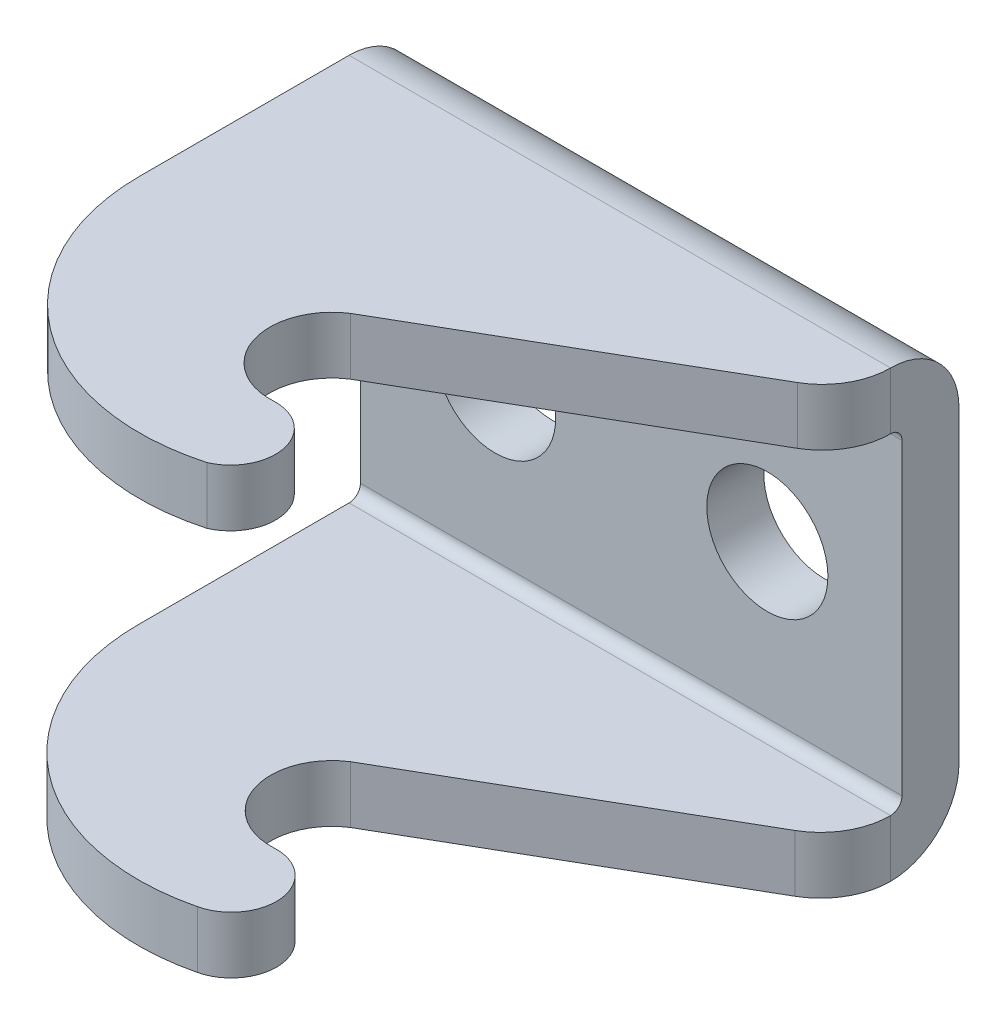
ISO-10303-21;
HEADER;
FILE_DESCRIPTION(('STEP AP214'),'2;1');
FILE_NAME('part.step','',(''),(''),'','','');
FILE_SCHEMA(('AUTOMOTIVE_DESIGN { 1 0 10303 214 1 1 1 1 }'));
ENDSEC;
DATA;
#1=APPLICATION_CONTEXT('core data for automotive mechanical design processes');
#2=APPLICATION_PROTOCOL_DEFINITION('international standard','automotive_design',2000,#1);
#3=PRODUCT_CONTEXT('',#1,'mechanical');
#4=PRODUCT('Part','Part','',(#3));
#5=PRODUCT_RELATED_PRODUCT_CATEGORY('part','',(#4));
#6=PRODUCT_DEFINITION_FORMATION('','',#4);
#7=PRODUCT_DEFINITION_CONTEXT('part definition',#1,'design');
#8=PRODUCT_DEFINITION('design','',#6,#7);
#9=PRODUCT_DEFINITION_SHAPE('','',#8);
#10=(LENGTH_UNIT() NAMED_UNIT(*) SI_UNIT(.MILLI.,.METRE.));
#11=(NAMED_UNIT(*) PLANE_ANGLE_UNIT() SI_UNIT($,.RADIAN.));
#12=(NAMED_UNIT(*) SI_UNIT($,.STERADIAN.) SOLID_ANGLE_UNIT());
#13=UNCERTAINTY_MEASURE_WITH_UNIT(LENGTH_MEASURE(1.E-05),#10,'distance_accuracy_value','');
#14=(GEOMETRIC_REPRESENTATION_CONTEXT(3) GLOBAL_UNCERTAINTY_ASSIGNED_CONTEXT((#13)) GLOBAL_UNIT_ASSIGNED_CONTEXT((#10,
#11,#12)) REPRESENTATION_CONTEXT('',''));
#15=CARTESIAN_POINT('',(0.,0.,0.));
#16=DIRECTION('',(0.,0.,1.));
#17=DIRECTION('',(1.,0.,0.));
#18=AXIS2_PLACEMENT_3D('',#15,#16,#17);
#19=CARTESIAN_POINT('',(9.05,15.6,31.6254571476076));
#20=DIRECTION('',(0.,-1.,0.));
#21=DIRECTION('',(0.,0.,1.));
#22=AXIS2_PLACEMENT_3D('',#19,#20,#21);
#23=PLANE('',#22);
#24=DIRECTION('',(1.,0.,0.));
#25=VECTOR('',#24,1.);
#26=CARTESIAN_POINT('',(-28.9122467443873,15.6,4.8));
#27=LINE('',#26,#25);
#28=CARTESIAN_POINT('',(-9.4499999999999,15.6,4.8));
#29=VERTEX_POINT('',#28);
#30=CARTESIAN_POINT('',(28.55,15.6,4.8));
#31=VERTEX_POINT('',#30);
#32=EDGE_CURVE('E300',#29,#31,#27,.T.);
#33=ORIENTED_EDGE('',*,*,#32,.F.);
#34=DIRECTION('',(0.,0.,1.));
#35=VECTOR('',#34,1.);
#36=CARTESIAN_POINT('',(-9.4499999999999,15.6,19.5041133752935));
#37=LINE('',#36,#35);
#38=CARTESIAN_POINT('',(-9.4499999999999,15.6,19.5041133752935));
#39=VERTEX_POINT('',#38);
#40=EDGE_CURVE('E264',#39,#29,#37,.F.);
#41=ORIENTED_EDGE('',*,*,#40,.F.);
#42=CARTESIAN_POINT('',(6.1467717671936,15.6,19.5041133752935));
#43=DIRECTION('',(0.,-1.,0.));
#44=DIRECTION('',(0.,0.,1.));
#45=AXIS2_PLACEMENT_3D('',#42,#43,#44);
#46=CIRCLE('',#45,15.5967717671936);
#47=CARTESIAN_POINT('',(10.3055796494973,15.6,34.5361992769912));
#48=VERTEX_POINT('',#47);
#49=EDGE_CURVE('E145',#48,#39,#46,.T.);
#50=ORIENTED_EDGE('',*,*,#49,.F.);
#51=CARTESIAN_POINT('',(9.05,15.6,31.6254571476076));
#52=DIRECTION('',(0.,-1.,0.));
#53=DIRECTION('',(0.,0.,1.));
#54=AXIS2_PLACEMENT_3D('',#51,#52,#53);
#55=CIRCLE('',#54,3.17);
#56=CARTESIAN_POINT('',(8.92464388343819,15.6,28.4579366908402));
#57=VERTEX_POINT('',#56);
#58=EDGE_CURVE('E143',#57,#48,#55,.T.);
#59=ORIENTED_EDGE('',*,*,#58,.F.);
#60=CARTESIAN_POINT('',(8.65,15.6,24.1008851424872));
#61=DIRECTION('',(0.,-1.,0.));
#62=DIRECTION('',(0.,0.,1.));
#63=AXIS2_PLACEMENT_3D('',#60,#61,#62);
#64=CIRCLE('',#63,4.36569896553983);
#65=CARTESIAN_POINT('',(6.28596056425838,15.6,20.4306474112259));
#66=VERTEX_POINT('',#65);
#67=EDGE_CURVE('E132',#57,#66,#64,.T.);
#68=ORIENTED_EDGE('',*,*,#67,.T.);
#69=DIRECTION('',(0.86602540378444,0.,-0.5));
#70=VECTOR('',#69,1.);
#71=CARTESIAN_POINT('',(26.1618466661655,15.6,8.95529921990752));
#72=LINE('',#71,#70);
#73=CARTESIAN_POINT('',(26.1618466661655,15.6,8.95529921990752));
#74=VERTEX_POINT('',#73);
#75=EDGE_CURVE('E159',#74,#66,#72,.F.);
#76=ORIENTED_EDGE('',*,*,#75,.F.);
#77=CARTESIAN_POINT('',(23.7736933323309,15.6,4.81889630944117));
#78=DIRECTION('',(0.,-1.,0.));
#79=DIRECTION('',(0.,0.,1.));
#80=AXIS2_PLACEMENT_3D('',#77,#78,#79);
#81=CIRCLE('',#80,4.77630666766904);
#82=CARTESIAN_POINT('',(28.55,15.6,4.81889630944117));
#83=VERTEX_POINT('',#82);
#84=EDGE_CURVE('E17',#83,#74,#81,.T.);
#85=ORIENTED_EDGE('',*,*,#84,.F.);
#86=DIRECTION('',(0.,0.,-1.));
#87=VECTOR('',#86,1.);
#88=CARTESIAN_POINT('',(28.55,15.6,-25.6171260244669));
#89=LINE('',#88,#87);
#90=EDGE_CURVE('E173',#31,#83,#89,.F.);
#91=ORIENTED_EDGE('',*,*,#90,.F.);
#92=EDGE_LOOP('',(#33,#41,#50,#59,#68,#76,#85,#91));
#93=FACE_BOUND('',#92,.T.);
#94=ADVANCED_FACE('F14',(#93),#23,.F.);
#95=CARTESIAN_POINT('',(9.04999999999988,-15.6017702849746,-52.4236868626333));
#96=DIRECTION('',(0.,1.,0.));
#97=DIRECTION('',(0.,0.,-1.));
#98=AXIS2_PLACEMENT_3D('',#95,#96,#97);
#99=PLANE('',#98);
#100=DIRECTION('',(0.,0.,-1.));
#101=VECTOR('',#100,1.);
#102=CARTESIAN_POINT('',(28.55,-15.6017702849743,4.81889630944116));
#103=LINE('',#102,#101);
#104=CARTESIAN_POINT('',(28.55,-15.6017702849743,4.81889630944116));
#105=VERTEX_POINT('',#104);
#106=CARTESIAN_POINT('',(28.55,-15.6017702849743,4.80000000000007));
#107=VERTEX_POINT('',#106);
#108=EDGE_CURVE('E169',#105,#107,#103,.T.);
#109=ORIENTED_EDGE('',*,*,#108,.F.);
#110=CARTESIAN_POINT('',(23.6563893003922,-15.6017702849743,4.81889630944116));
#111=DIRECTION('',(0.,1.,0.));
#112=DIRECTION('',(0.,0.,-1.));
#113=AXIS2_PLACEMENT_3D('',#110,#111,#112);
#114=CIRCLE('',#113,4.89361069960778);
#115=CARTESIAN_POINT('',(26.1031946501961,-15.6017702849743,9.05688749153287));
#116=VERTEX_POINT('',#115);
#117=EDGE_CURVE('E247',#116,#105,#114,.T.);
#118=ORIENTED_EDGE('',*,*,#117,.F.);
#119=DIRECTION('',(0.866025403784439,0.,-0.5));
#120=VECTOR('',#119,1.);
#121=CARTESIAN_POINT('',(6.32962411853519,-15.6017702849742,20.4731637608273));
#122=LINE('',#121,#120);
#123=CARTESIAN_POINT('',(6.32962411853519,-15.6017702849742,20.4731637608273));
#124=VERTEX_POINT('',#123);
#125=EDGE_CURVE('E176',#124,#116,#122,.T.);
#126=ORIENTED_EDGE('',*,*,#125,.F.);
#127=CARTESIAN_POINT('',(8.65,-15.6017702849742,24.1008851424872));
#128=DIRECTION('',(0.,1.,0.));
#129=DIRECTION('',(0.,0.,-1.));
#130=AXIS2_PLACEMENT_3D('',#127,#128,#129);
#131=CIRCLE('',#130,4.30633331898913);
#132=CARTESIAN_POINT('',(8.88039814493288,-15.6017702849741,28.4010506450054));
#133=VERTEX_POINT('',#132);
#134=EDGE_CURVE('E250',#124,#133,#131,.T.);
#135=ORIENTED_EDGE('',*,*,#134,.T.);
#136=CARTESIAN_POINT('',(9.04999999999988,-15.6017702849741,31.5665103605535));
#137=DIRECTION('',(0.,1.,0.));
#138=DIRECTION('',(0.,0.,-1.));
#139=AXIS2_PLACEMENT_3D('',#136,#137,#138);
#140=CIRCLE('',#139,3.17);
#141=CARTESIAN_POINT('',(9.76428445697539,-15.6017702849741,34.6549885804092));
#142=VERTEX_POINT('',#141);
#143=EDGE_CURVE('E255',#142,#133,#140,.T.);
#144=ORIENTED_EDGE('',*,*,#143,.F.);
#145=CARTESIAN_POINT('',(6.07069648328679,-15.6017702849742,19.5800031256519));
#146=DIRECTION('',(0.,1.,0.));
#147=DIRECTION('',(0.,0.,-1.));
#148=AXIS2_PLACEMENT_3D('',#145,#146,#147);
#149=CIRCLE('',#148,15.5208820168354);
#150=CARTESIAN_POINT('',(-9.45000000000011,-15.6017702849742,19.5041133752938));
#151=VERTEX_POINT('',#150);
#152=EDGE_CURVE('E257',#151,#142,#149,.T.);
#153=ORIENTED_EDGE('',*,*,#152,.F.);
#154=DIRECTION('',(0.,0.,-1.));
#155=VECTOR('',#154,1.);
#156=CARTESIAN_POINT('',(-9.45000000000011,-15.6017702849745,-40.3023430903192));
#157=LINE('',#156,#155);
#158=CARTESIAN_POINT('',(-9.45000000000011,-15.6017702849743,4.8));
#159=VERTEX_POINT('',#158);
#160=EDGE_CURVE('E294',#159,#151,#157,.F.);
#161=ORIENTED_EDGE('',*,*,#160,.F.);
#162=DIRECTION('',(1.,0.,0.));
#163=VECTOR('',#162,1.);
#164=CARTESIAN_POINT('',(-28.9122467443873,-15.6017702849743,4.80000000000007));
#165=LINE('',#164,#163);
#166=EDGE_CURVE('E297',#107,#159,#165,.F.);
#167=ORIENTED_EDGE('',*,*,#166,.F.);
#168=EDGE_LOOP('',(#109,#118,#126,#135,#144,#153,#161,#167));
#169=FACE_BOUND('',#168,.T.);
#170=ADVANCED_FACE('F375',(#169),#99,.F.);
#171=CARTESIAN_POINT('',(23.7736933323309,15.6,4.81889630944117));
#172=DIRECTION('',(0.,-1.,0.));
#173=DIRECTION('',(0.,0.,1.));
#174=AXIS2_PLACEMENT_3D('',#171,#172,#173);
#175=CYLINDRICAL_SURFACE('',#174,4.77630666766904);
#176=ORIENTED_EDGE('',*,*,#84,.T.);
#177=DIRECTION('',(0.,1.,0.));
#178=VECTOR('',#177,1.);
#179=CARTESIAN_POINT('',(26.1618466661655,15.6,8.95529921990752));
#180=LINE('',#179,#178);
#181=CARTESIAN_POINT('',(26.1618466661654,11.6,8.95529921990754));
#182=VERTEX_POINT('',#181);
#183=EDGE_CURVE('E160',#182,#74,#180,.T.);
#184=ORIENTED_EDGE('',*,*,#183,.F.);
#185=CARTESIAN_POINT('',(23.7736933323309,11.6,4.81889630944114));
#186=DIRECTION('',(0.,-1.,0.));
#187=DIRECTION('',(0.,0.,1.));
#188=AXIS2_PLACEMENT_3D('',#185,#186,#187);
#189=CIRCLE('',#188,4.77630666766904);
#190=CARTESIAN_POINT('',(28.55,11.6,4.81889630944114));
#191=VERTEX_POINT('',#190);
#192=EDGE_CURVE('E232',#191,#182,#189,.T.);
#193=ORIENTED_EDGE('',*,*,#192,.F.);
#194=DIRECTION('',(0.,-1.,0.));
#195=VECTOR('',#194,1.);
#196=CARTESIAN_POINT('',(28.55,15.6,4.81889630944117));
#197=LINE('',#196,#195);
#198=EDGE_CURVE('E163',#191,#83,#197,.F.);
#199=ORIENTED_EDGE('',*,*,#198,.T.);
#200=EDGE_LOOP('',(#176,#184,#193,#199));
#201=FACE_BOUND('',#200,.T.);
#202=ADVANCED_FACE('F364',(#201),#175,.T.);
#203=CARTESIAN_POINT('',(26.1618466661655,15.6,8.95529921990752));
#204=DIRECTION('',(0.5,0.,0.86602540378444));
#205=DIRECTION('',(0.86602540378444,0.,-0.5));
#206=AXIS2_PLACEMENT_3D('',#203,#204,#205);
#207=PLANE('',#206);
#208=ORIENTED_EDGE('',*,*,#75,.T.);
#209=DIRECTION('',(0.,-1.,0.));
#210=VECTOR('',#209,1.);
#211=CARTESIAN_POINT('',(6.28596056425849,15.6,20.4306474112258));
#212=LINE('',#211,#210);
#213=CARTESIAN_POINT('',(6.28596056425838,11.6,20.4306474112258));
#214=VERTEX_POINT('',#213);
#215=EDGE_CURVE('E139',#66,#214,#212,.T.);
#216=ORIENTED_EDGE('',*,*,#215,.T.);
#217=DIRECTION('',(-0.86602540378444,0.,0.5));
#218=VECTOR('',#217,1.);
#219=CARTESIAN_POINT('',(26.1618466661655,11.6,8.95529921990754));
#220=LINE('',#219,#218);
#221=EDGE_CURVE('E231',#182,#214,#220,.T.);
#222=ORIENTED_EDGE('',*,*,#221,.F.);
#223=ORIENTED_EDGE('',*,*,#183,.T.);
#224=EDGE_LOOP('',(#208,#216,#222,#223));
#225=FACE_BOUND('',#224,.T.);
#226=ADVANCED_FACE('F365',(#225),#207,.T.);
#227=CARTESIAN_POINT('',(8.65,15.6,24.1008851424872));
#228=DIRECTION('',(0.,-1.,0.));
#229=DIRECTION('',(0.,0.,1.));
#230=AXIS2_PLACEMENT_3D('',#227,#228,#229);
#231=CYLINDRICAL_SURFACE('',#230,4.36569896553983);
#232=ORIENTED_EDGE('',*,*,#67,.F.);
#233=DIRECTION('',(0.,-1.,0.));
#234=VECTOR('',#233,1.);
#235=CARTESIAN_POINT('',(8.92464388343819,15.6,28.4579366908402));
#236=LINE('',#235,#234);
#237=CARTESIAN_POINT('',(8.92464388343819,11.6,28.4579366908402));
#238=VERTEX_POINT('',#237);
#239=EDGE_CURVE('E137',#238,#57,#236,.F.);
#240=ORIENTED_EDGE('',*,*,#239,.F.);
#241=CARTESIAN_POINT('',(8.65,11.6,24.1008851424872));
#242=DIRECTION('',(0.,-1.,0.));
#243=DIRECTION('',(0.,0.,1.));
#244=AXIS2_PLACEMENT_3D('',#241,#242,#243);
#245=CIRCLE('',#244,4.36569896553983);
#246=EDGE_CURVE('E228',#214,#238,#245,.F.);
#247=ORIENTED_EDGE('',*,*,#246,.F.);
#248=ORIENTED_EDGE('',*,*,#215,.F.);
#249=EDGE_LOOP('',(#232,#240,#247,#248));
#250=FACE_BOUND('',#249,.T.);
#251=ADVANCED_FACE('F134',(#250),#231,.F.);
#252=CARTESIAN_POINT('',(9.05,15.6,31.6254571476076));
#253=DIRECTION('',(0.,-1.,0.));
#254=DIRECTION('',(0.,0.,1.));
#255=AXIS2_PLACEMENT_3D('',#252,#253,#254);
#256=CYLINDRICAL_SURFACE('',#255,3.17);
#257=ORIENTED_EDGE('',*,*,#58,.T.);
#258=DIRECTION('',(0.,-1.,0.));
#259=VECTOR('',#258,1.);
#260=CARTESIAN_POINT('',(10.3055796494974,15.6,34.5361992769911));
#261=LINE('',#260,#259);
#262=CARTESIAN_POINT('',(10.3055796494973,11.6,34.5361992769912));
#263=VERTEX_POINT('',#262);
#264=EDGE_CURVE('E149',#263,#48,#261,.F.);
#265=ORIENTED_EDGE('',*,*,#264,.F.);
#266=CARTESIAN_POINT('',(9.05,11.6,31.6254571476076));
#267=DIRECTION('',(0.,-1.,0.));
#268=DIRECTION('',(0.,0.,1.));
#269=AXIS2_PLACEMENT_3D('',#266,#267,#268);
#270=CIRCLE('',#269,3.17);
#271=EDGE_CURVE('E153',#238,#263,#270,.T.);
#272=ORIENTED_EDGE('',*,*,#271,.F.);
#273=ORIENTED_EDGE('',*,*,#239,.T.);
#274=EDGE_LOOP('',(#257,#265,#272,#273));
#275=FACE_BOUND('',#274,.T.);
#276=ADVANCED_FACE('F151',(#275),#256,.T.);
#277=CARTESIAN_POINT('',(6.1467717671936,15.6,19.5041133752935));
#278=DIRECTION('',(0.,-1.,0.));
#279=DIRECTION('',(0.,0.,1.));
#280=AXIS2_PLACEMENT_3D('',#277,#278,#279);
#281=CYLINDRICAL_SURFACE('',#280,15.5967717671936);
#282=DIRECTION('',(0.,1.,0.));
#283=VECTOR('',#282,1.);
#284=CARTESIAN_POINT('',(-9.4499999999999,15.6,19.5041133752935));
#285=LINE('',#284,#283);
#286=CARTESIAN_POINT('',(-9.4499999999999,11.6,19.5041133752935));
#287=VERTEX_POINT('',#286);
#288=EDGE_CURVE('E261',#287,#39,#285,.T.);
#289=ORIENTED_EDGE('',*,*,#288,.F.);
#290=CARTESIAN_POINT('',(6.1467717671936,11.6,19.5041133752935));
#291=DIRECTION('',(0.,-1.,0.));
#292=DIRECTION('',(0.,0.,1.));
#293=AXIS2_PLACEMENT_3D('',#290,#291,#292);
#294=CIRCLE('',#293,15.5967717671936);
#295=EDGE_CURVE('E224',#263,#287,#294,.T.);
#296=ORIENTED_EDGE('',*,*,#295,.F.);
#297=ORIENTED_EDGE('',*,*,#264,.T.);
#298=ORIENTED_EDGE('',*,*,#49,.T.);
#299=EDGE_LOOP('',(#289,#296,#297,#298));
#300=FACE_BOUND('',#299,.T.);
#301=ADVANCED_FACE('F265',(#300),#281,.T.);
#302=CARTESIAN_POINT('',(-28.9122467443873,10.8,4.8));
#303=DIRECTION('',(1.,0.,0.));
#304=DIRECTION('',(0.,0.,-1.));
#305=AXIS2_PLACEMENT_3D('',#302,#303,#304);
#306=CYLINDRICAL_SURFACE('',#305,4.8);
#307=CARTESIAN_POINT('',(28.55,10.8,4.8));
#308=DIRECTION('',(1.,0.,0.));
#309=DIRECTION('',(0.,0.,-1.));
#310=AXIS2_PLACEMENT_3D('',#307,#308,#309);
#311=CIRCLE('',#310,4.8);
#312=CARTESIAN_POINT('',(28.55,10.8,0.));
#313=VERTEX_POINT('',#312);
#314=EDGE_CURVE('E241',#313,#31,#311,.T.);
#315=ORIENTED_EDGE('',*,*,#314,.F.);
#316=DIRECTION('',(-1.,0.,0.));
#317=VECTOR('',#316,1.);
#318=CARTESIAN_POINT('',(9.05,10.8,0.));
#319=LINE('',#318,#317);
#320=CARTESIAN_POINT('',(-9.4499999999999,10.8,0.));
#321=VERTEX_POINT('',#320);
#322=EDGE_CURVE('E218',#313,#321,#319,.T.);
#323=ORIENTED_EDGE('',*,*,#322,.T.);
#324=CARTESIAN_POINT('',(-9.4499999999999,10.8,4.8));
#325=DIRECTION('',(1.,0.,0.));
#326=DIRECTION('',(0.,0.,-1.));
#327=AXIS2_PLACEMENT_3D('',#324,#325,#326);
#328=CIRCLE('',#327,4.8);
#329=EDGE_CURVE('E219',#29,#321,#328,.F.);
#330=ORIENTED_EDGE('',*,*,#329,.F.);
#331=ORIENTED_EDGE('',*,*,#32,.T.);
#332=EDGE_LOOP('',(#315,#323,#330,#331));
#333=FACE_BOUND('',#332,.T.);
#334=ADVANCED_FACE('F311',(#333),#306,.T.);
#335=CARTESIAN_POINT('',(-28.9122467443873,-10.8017702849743,4.8));
#336=DIRECTION('',(1.,0.,0.));
#337=DIRECTION('',(0.,0.,-1.));
#338=AXIS2_PLACEMENT_3D('',#335,#336,#337);
#339=CYLINDRICAL_SURFACE('',#338,4.8);
#340=CARTESIAN_POINT('',(28.55,-10.8017702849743,4.8));
#341=DIRECTION('',(1.,0.,0.));
#342=DIRECTION('',(0.,0.,-1.));
#343=AXIS2_PLACEMENT_3D('',#340,#341,#342);
#344=CIRCLE('',#343,4.8);
#345=CARTESIAN_POINT('',(28.55,-10.8017702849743,0.));
#346=VERTEX_POINT('',#345);
#347=EDGE_CURVE('E235',#107,#346,#344,.T.);
#348=ORIENTED_EDGE('',*,*,#347,.F.);
#349=ORIENTED_EDGE('',*,*,#166,.T.);
#350=CARTESIAN_POINT('',(-9.45000000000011,-10.8017702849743,4.8));
#351=DIRECTION('',(1.,0.,0.));
#352=DIRECTION('',(0.,0.,-1.));
#353=AXIS2_PLACEMENT_3D('',#350,#351,#352);
#354=CIRCLE('',#353,4.8);
#355=CARTESIAN_POINT('',(-9.45000000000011,-10.8017702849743,0.));
#356=VERTEX_POINT('',#355);
#357=EDGE_CURVE('E214',#356,#159,#354,.F.);
#358=ORIENTED_EDGE('',*,*,#357,.F.);
#359=DIRECTION('',(-1.,0.,0.));
#360=VECTOR('',#359,1.);
#361=CARTESIAN_POINT('',(9.05,-10.8017702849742,0.));
#362=LINE('',#361,#360);
#363=EDGE_CURVE('E222',#356,#346,#362,.F.);
#364=ORIENTED_EDGE('',*,*,#363,.T.);
#365=EDGE_LOOP('',(#348,#349,#358,#364));
#366=FACE_BOUND('',#365,.T.);
#367=ADVANCED_FACE('F425',(#366),#339,.T.);
#368=CARTESIAN_POINT('',(6.07069648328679,-15.6017702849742,19.5800031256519));
#369=DIRECTION('',(0.,1.,0.));
#370=DIRECTION('',(0.,0.,-1.));
#371=AXIS2_PLACEMENT_3D('',#368,#369,#370);
#372=CYLINDRICAL_SURFACE('',#371,15.5208820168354);
#373=ORIENTED_EDGE('',*,*,#152,.T.);
#374=DIRECTION('',(0.,1.,0.));
#375=VECTOR('',#374,1.);
#376=CARTESIAN_POINT('',(9.76428445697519,-15.6017702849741,34.6549885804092));
#377=LINE('',#376,#375);
#378=CARTESIAN_POINT('',(9.76428445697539,-11.6017702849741,34.6549885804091));
#379=VERTEX_POINT('',#378);
#380=EDGE_CURVE('E254',#379,#142,#377,.F.);
#381=ORIENTED_EDGE('',*,*,#380,.F.);
#382=CARTESIAN_POINT('',(6.07069648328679,-11.6017702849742,19.5800031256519));
#383=DIRECTION('',(0.,1.,0.));
#384=DIRECTION('',(0.,0.,-1.));
#385=AXIS2_PLACEMENT_3D('',#382,#383,#384);
#386=CIRCLE('',#385,15.5208820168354);
#387=CARTESIAN_POINT('',(-9.45000000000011,-11.6017702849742,19.5041133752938));
#388=VERTEX_POINT('',#387);
#389=EDGE_CURVE('E210',#388,#379,#386,.T.);
#390=ORIENTED_EDGE('',*,*,#389,.F.);
#391=DIRECTION('',(0.,1.,0.));
#392=VECTOR('',#391,1.);
#393=CARTESIAN_POINT('',(-9.45000000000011,-15.6017702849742,19.5041133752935));
#394=LINE('',#393,#392);
#395=EDGE_CURVE('E260',#388,#151,#394,.F.);
#396=ORIENTED_EDGE('',*,*,#395,.T.);
#397=EDGE_LOOP('',(#373,#381,#390,#396));
#398=FACE_BOUND('',#397,.T.);
#399=ADVANCED_FACE('F421',(#398),#372,.T.);
#400=CARTESIAN_POINT('',(9.04999999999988,-15.6017702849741,31.5665103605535));
#401=DIRECTION('',(0.,1.,0.));
#402=DIRECTION('',(0.,0.,-1.));
#403=AXIS2_PLACEMENT_3D('',#400,#401,#402);
#404=CYLINDRICAL_SURFACE('',#403,3.17);
#405=CARTESIAN_POINT('',(9.04999999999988,-11.6017702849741,31.5665103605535));
#406=DIRECTION('',(0.,1.,0.));
#407=DIRECTION('',(0.,0.,-1.));
#408=AXIS2_PLACEMENT_3D('',#405,#406,#407);
#409=CIRCLE('',#408,3.17);
#410=CARTESIAN_POINT('',(8.88039814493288,-11.6017702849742,28.4010506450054));
#411=VERTEX_POINT('',#410);
#412=EDGE_CURVE('E208',#379,#411,#409,.T.);
#413=ORIENTED_EDGE('',*,*,#412,.F.);
#414=ORIENTED_EDGE('',*,*,#380,.T.);
#415=ORIENTED_EDGE('',*,*,#143,.T.);
#416=DIRECTION('',(0.,1.,0.));
#417=VECTOR('',#416,1.);
#418=CARTESIAN_POINT('',(8.88039814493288,-15.6017702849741,28.4010506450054));
#419=LINE('',#418,#417);
#420=EDGE_CURVE('E253',#133,#411,#419,.T.);
#421=ORIENTED_EDGE('',*,*,#420,.T.);
#422=EDGE_LOOP('',(#413,#414,#415,#421));
#423=FACE_BOUND('',#422,.T.);
#424=ADVANCED_FACE('F417',(#423),#404,.T.);
#425=CARTESIAN_POINT('',(8.65,-15.6017702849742,24.1008851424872));
#426=DIRECTION('',(0.,1.,0.));
#427=DIRECTION('',(0.,0.,-1.));
#428=AXIS2_PLACEMENT_3D('',#425,#426,#427);
#429=CYLINDRICAL_SURFACE('',#428,4.30633331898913);
#430=ORIENTED_EDGE('',*,*,#420,.F.);
#431=ORIENTED_EDGE('',*,*,#134,.F.);
#432=DIRECTION('',(0.,1.,0.));
#433=VECTOR('',#432,1.);
#434=CARTESIAN_POINT('',(6.32962411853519,-15.6017702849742,20.4731637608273));
#435=LINE('',#434,#433);
#436=CARTESIAN_POINT('',(6.32962411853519,-11.6017702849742,20.4731637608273));
#437=VERTEX_POINT('',#436);
#438=EDGE_CURVE('E179',#437,#124,#435,.F.);
#439=ORIENTED_EDGE('',*,*,#438,.F.);
#440=CARTESIAN_POINT('',(8.65,-11.6017702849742,24.1008851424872));
#441=DIRECTION('',(0.,1.,0.));
#442=DIRECTION('',(0.,0.,-1.));
#443=AXIS2_PLACEMENT_3D('',#440,#441,#442);
#444=CIRCLE('',#443,4.30633331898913);
#445=EDGE_CURVE('E205',#411,#437,#444,.F.);
#446=ORIENTED_EDGE('',*,*,#445,.F.);
#447=EDGE_LOOP('',(#430,#431,#439,#446));
#448=FACE_BOUND('',#447,.T.);
#449=ADVANCED_FACE('F413',(#448),#429,.F.);
#450=CARTESIAN_POINT('',(6.32962411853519,-15.6017702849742,20.4731637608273));
#451=DIRECTION('',(0.5,0.,0.866025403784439));
#452=DIRECTION('',(0.866025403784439,0.,-0.5));
#453=AXIS2_PLACEMENT_3D('',#450,#451,#452);
#454=PLANE('',#453);
#455=ORIENTED_EDGE('',*,*,#125,.T.);
#456=DIRECTION('',(0.,1.,0.));
#457=VECTOR('',#456,1.);
#458=CARTESIAN_POINT('',(26.103194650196,-15.6017702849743,9.05688749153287));
#459=LINE('',#458,#457);
#460=CARTESIAN_POINT('',(26.1031946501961,-11.6017702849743,9.05688749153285));
#461=VERTEX_POINT('',#460);
#462=EDGE_CURVE('E178',#461,#116,#459,.F.);
#463=ORIENTED_EDGE('',*,*,#462,.F.);
#464=DIRECTION('',(0.866025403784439,0.,-0.5));
#465=VECTOR('',#464,1.);
#466=CARTESIAN_POINT('',(6.32962411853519,-11.6017702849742,20.4731637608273));
#467=LINE('',#466,#465);
#468=EDGE_CURVE('E204',#437,#461,#467,.T.);
#469=ORIENTED_EDGE('',*,*,#468,.F.);
#470=ORIENTED_EDGE('',*,*,#438,.T.);
#471=EDGE_LOOP('',(#455,#463,#469,#470));
#472=FACE_BOUND('',#471,.T.);
#473=ADVANCED_FACE('F409',(#472),#454,.T.);
#474=CARTESIAN_POINT('',(23.6563893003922,-15.6017702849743,4.81889630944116));
#475=DIRECTION('',(0.,1.,0.));
#476=DIRECTION('',(0.,0.,-1.));
#477=AXIS2_PLACEMENT_3D('',#474,#475,#476);
#478=CYLINDRICAL_SURFACE('',#477,4.89361069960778);
#479=ORIENTED_EDGE('',*,*,#117,.T.);
#480=DIRECTION('',(0.,1.,0.));
#481=VECTOR('',#480,1.);
#482=CARTESIAN_POINT('',(28.55,-15.6017702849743,4.81889630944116));
#483=LINE('',#482,#481);
#484=CARTESIAN_POINT('',(28.55,-11.6017702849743,4.81889630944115));
#485=VERTEX_POINT('',#484);
#486=EDGE_CURVE('E246',#105,#485,#483,.T.);
#487=ORIENTED_EDGE('',*,*,#486,.T.);
#488=CARTESIAN_POINT('',(23.6563893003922,-11.6017702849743,4.81889630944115));
#489=DIRECTION('',(0.,1.,0.));
#490=DIRECTION('',(0.,0.,-1.));
#491=AXIS2_PLACEMENT_3D('',#488,#489,#490);
#492=CIRCLE('',#491,4.89361069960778);
#493=EDGE_CURVE('E201',#461,#485,#492,.T.);
#494=ORIENTED_EDGE('',*,*,#493,.F.);
#495=ORIENTED_EDGE('',*,*,#462,.T.);
#496=EDGE_LOOP('',(#479,#487,#494,#495));
#497=FACE_BOUND('',#496,.T.);
#498=ADVANCED_FACE('F406',(#497),#478,.T.);
#499=CARTESIAN_POINT('',(9.05,11.6,31.6254571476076));
#500=DIRECTION('',(0.,-1.,0.));
#501=DIRECTION('',(0.,0.,1.));
#502=AXIS2_PLACEMENT_3D('',#499,#500,#501);
#503=PLANE('',#502);
#504=ORIENTED_EDGE('',*,*,#295,.T.);
#505=DIRECTION('',(0.,0.,1.));
#506=VECTOR('',#505,1.);
#507=CARTESIAN_POINT('',(-9.4499999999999,11.6,31.6254571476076));
#508=LINE('',#507,#506);
#509=CARTESIAN_POINT('',(-9.4499999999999,11.6,4.8));
#510=VERTEX_POINT('',#509);
#511=EDGE_CURVE('E223',#287,#510,#508,.F.);
#512=ORIENTED_EDGE('',*,*,#511,.T.);
#513=DIRECTION('',(1.,0.,0.));
#514=VECTOR('',#513,1.);
#515=CARTESIAN_POINT('',(-28.9122467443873,11.6,4.8));
#516=LINE('',#515,#514);
#517=CARTESIAN_POINT('',(28.55,11.6,4.8));
#518=VERTEX_POINT('',#517);
#519=EDGE_CURVE('E193',#510,#518,#516,.T.);
#520=ORIENTED_EDGE('',*,*,#519,.T.);
#521=DIRECTION('',(0.,0.,-1.));
#522=VECTOR('',#521,1.);
#523=CARTESIAN_POINT('',(28.55,11.5999999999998,-25.6171260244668));
#524=LINE('',#523,#522);
#525=EDGE_CURVE('E172',#191,#518,#524,.T.);
#526=ORIENTED_EDGE('',*,*,#525,.F.);
#527=ORIENTED_EDGE('',*,*,#192,.T.);
#528=ORIENTED_EDGE('',*,*,#221,.T.);
#529=ORIENTED_EDGE('',*,*,#246,.T.);
#530=ORIENTED_EDGE('',*,*,#271,.T.);
#531=EDGE_LOOP('',(#504,#512,#520,#526,#527,#528,#529,#530));
#532=FACE_BOUND('',#531,.T.);
#533=ADVANCED_FACE('F267',(#532),#503,.T.);
#534=CARTESIAN_POINT('',(9.05,42.0236868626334,0.));
#535=DIRECTION('',(0.,0.,1.));
#536=DIRECTION('',(0.,1.,0.));
#537=AXIS2_PLACEMENT_3D('',#534,#535,#536);
#538=PLANE('',#537);
#539=DIRECTION('',(0.,1.,0.));
#540=VECTOR('',#539,1.);
#541=CARTESIAN_POINT('',(28.55,-15.2188963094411,0.));
#542=LINE('',#541,#540);
#543=EDGE_CURVE('E197',#346,#313,#542,.T.);
#544=ORIENTED_EDGE('',*,*,#543,.F.);
#545=ORIENTED_EDGE('',*,*,#363,.F.);
#546=DIRECTION('',(0.,1.,0.));
#547=VECTOR('',#546,1.);
#548=CARTESIAN_POINT('',(-9.4499999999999,29.9023430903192,0.));
#549=LINE('',#548,#547);
#550=EDGE_CURVE('E192',#321,#356,#549,.F.);
#551=ORIENTED_EDGE('',*,*,#550,.F.);
#552=ORIENTED_EDGE('',*,*,#322,.F.);
#553=EDGE_LOOP('',(#544,#545,#551,#552));
#554=FACE_BOUND('',#553,.T.);
#555=CARTESIAN_POINT('',(19.1,-0.0806437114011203,0.));
#556=DIRECTION('',(0.,0.,-1.));
#557=DIRECTION('',(0.,-1.,0.));
#558=AXIS2_PLACEMENT_3D('',#555,#556,#557);
#559=CIRCLE('',#558,4.25);
#560=CARTESIAN_POINT('',(19.1,-4.33064371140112,0.));
#561=VERTEX_POINT('',#560);
#562=EDGE_CURVE('E194',#561,#561,#559,.F.);
#563=ORIENTED_EDGE('',*,*,#562,.T.);
#564=EDGE_LOOP('',(#563));
#565=FACE_BOUND('',#564,.T.);
#566=CARTESIAN_POINT('',(0.,0.,0.));
#567=DIRECTION('',(0.,0.,-1.));
#568=DIRECTION('',(0.,-1.,0.));
#569=AXIS2_PLACEMENT_3D('',#566,#567,#568);
#570=CIRCLE('',#569,4.25);
#571=CARTESIAN_POINT('',(0.,-4.25,0.));
#572=VERTEX_POINT('',#571);
#573=EDGE_CURVE('E198',#572,#572,#570,.F.);
#574=ORIENTED_EDGE('',*,*,#573,.T.);
#575=EDGE_LOOP('',(#574));
#576=FACE_BOUND('',#575,.T.);
#577=ADVANCED_FACE('F401',(#554,#565,#576),#538,.F.);
#578=CARTESIAN_POINT('',(9.04999999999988,-11.6017702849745,-52.4236868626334));
#579=DIRECTION('',(0.,1.,0.));
#580=DIRECTION('',(0.,0.,-1.));
#581=AXIS2_PLACEMENT_3D('',#578,#579,#580);
#582=PLANE('',#581);
#583=ORIENTED_EDGE('',*,*,#468,.T.);
#584=ORIENTED_EDGE('',*,*,#493,.T.);
#585=DIRECTION('',(0.,0.,-1.));
#586=VECTOR('',#585,1.);
#587=CARTESIAN_POINT('',(28.55,-11.6017702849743,4.81889630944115));
#588=LINE('',#587,#586);
#589=CARTESIAN_POINT('',(28.55,-11.6017702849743,4.8));
#590=VERTEX_POINT('',#589);
#591=EDGE_CURVE('E166',#590,#485,#588,.F.);
#592=ORIENTED_EDGE('',*,*,#591,.F.);
#593=DIRECTION('',(1.,0.,0.));
#594=VECTOR('',#593,1.);
#595=CARTESIAN_POINT('',(-28.9122467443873,-11.6017702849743,4.8));
#596=LINE('',#595,#594);
#597=CARTESIAN_POINT('',(-9.45000000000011,-11.6017702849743,4.8));
#598=VERTEX_POINT('',#597);
#599=EDGE_CURVE('E188',#590,#598,#596,.F.);
#600=ORIENTED_EDGE('',*,*,#599,.T.);
#601=DIRECTION('',(0.,0.,-1.));
#602=VECTOR('',#601,1.);
#603=CARTESIAN_POINT('',(-9.45000000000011,-11.6017702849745,-52.4236868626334));
#604=LINE('',#603,#602);
#605=EDGE_CURVE('E213',#598,#388,#604,.F.);
#606=ORIENTED_EDGE('',*,*,#605,.T.);
#607=ORIENTED_EDGE('',*,*,#389,.T.);
#608=ORIENTED_EDGE('',*,*,#412,.T.);
#609=ORIENTED_EDGE('',*,*,#445,.T.);
#610=EDGE_LOOP('',(#583,#584,#592,#600,#606,#607,#608,#609));
#611=FACE_BOUND('',#610,.T.);
#612=ADVANCED_FACE('F351',(#611),#582,.T.);
#613=CARTESIAN_POINT('',(0.,0.,0.));
#614=DIRECTION('',(0.,0.,-1.));
#615=DIRECTION('',(0.,-1.,0.));
#616=AXIS2_PLACEMENT_3D('',#613,#614,#615);
#617=CYLINDRICAL_SURFACE('',#616,4.25);
#618=CARTESIAN_POINT('',(0.,0.,4.));
#619=DIRECTION('',(0.,0.,-1.));
#620=DIRECTION('',(0.,-1.,0.));
#621=AXIS2_PLACEMENT_3D('',#618,#619,#620);
#622=CIRCLE('',#621,4.25);
#623=CARTESIAN_POINT('',(0.,-4.25,4.00000000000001));
#624=VERTEX_POINT('',#623);
#625=EDGE_CURVE('E185',#624,#624,#622,.T.);
#626=ORIENTED_EDGE('',*,*,#625,.F.);
#627=EDGE_LOOP('',(#626));
#628=FACE_BOUND('',#627,.T.);
#629=ORIENTED_EDGE('',*,*,#573,.F.);
#630=EDGE_LOOP('',(#629));
#631=FACE_BOUND('',#630,.T.);
#632=ADVANCED_FACE('F394',(#628,#631),#617,.F.);
#633=CARTESIAN_POINT('',(19.1,-0.0806437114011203,0.));
#634=DIRECTION('',(0.,0.,-1.));
#635=DIRECTION('',(0.,-1.,0.));
#636=AXIS2_PLACEMENT_3D('',#633,#634,#635);
#637=CYLINDRICAL_SURFACE('',#636,4.25);
#638=CARTESIAN_POINT('',(19.1,-0.0806437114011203,4.));
#639=DIRECTION('',(0.,0.,-1.));
#640=DIRECTION('',(0.,-1.,0.));
#641=AXIS2_PLACEMENT_3D('',#638,#639,#640);
#642=CIRCLE('',#641,4.25);
#643=CARTESIAN_POINT('',(19.1,-4.33064371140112,4.00000000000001));
#644=VERTEX_POINT('',#643);
#645=EDGE_CURVE('E181',#644,#644,#642,.T.);
#646=ORIENTED_EDGE('',*,*,#645,.F.);
#647=EDGE_LOOP('',(#646));
#648=FACE_BOUND('',#647,.T.);
#649=ORIENTED_EDGE('',*,*,#562,.F.);
#650=EDGE_LOOP('',(#649));
#651=FACE_BOUND('',#650,.T.);
#652=ADVANCED_FACE('F391',(#648,#651),#637,.F.);
#653=CARTESIAN_POINT('',(28.55,-15.2188963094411,0.));
#654=DIRECTION('',(1.,0.,0.));
#655=DIRECTION('',(0.,0.,-1.));
#656=AXIS2_PLACEMENT_3D('',#653,#654,#655);
#657=PLANE('',#656);
#658=DIRECTION('',(0.,1.,0.));
#659=VECTOR('',#658,1.);
#660=CARTESIAN_POINT('',(28.55,42.0236868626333,3.99999999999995));
#661=LINE('',#660,#659);
#662=CARTESIAN_POINT('',(28.55,-10.8017702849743,4.));
#663=VERTEX_POINT('',#662);
#664=CARTESIAN_POINT('',(28.55,10.8,4.));
#665=VERTEX_POINT('',#664);
#666=EDGE_CURVE('E184',#663,#665,#661,.T.);
#667=ORIENTED_EDGE('',*,*,#666,.F.);
#668=CARTESIAN_POINT('',(28.55,-10.8017702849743,4.8));
#669=DIRECTION('',(1.,0.,0.));
#670=DIRECTION('',(0.,0.,-1.));
#671=AXIS2_PLACEMENT_3D('',#668,#669,#670);
#672=CIRCLE('',#671,0.8);
#673=EDGE_CURVE('E238',#663,#590,#672,.F.);
#674=ORIENTED_EDGE('',*,*,#673,.T.);
#675=ORIENTED_EDGE('',*,*,#591,.T.);
#676=ORIENTED_EDGE('',*,*,#486,.F.);
#677=ORIENTED_EDGE('',*,*,#108,.T.);
#678=ORIENTED_EDGE('',*,*,#347,.T.);
#679=ORIENTED_EDGE('',*,*,#543,.T.);
#680=ORIENTED_EDGE('',*,*,#314,.T.);
#681=ORIENTED_EDGE('',*,*,#90,.T.);
#682=ORIENTED_EDGE('',*,*,#198,.F.);
#683=ORIENTED_EDGE('',*,*,#525,.T.);
#684=CARTESIAN_POINT('',(28.55,10.8,4.8));
#685=DIRECTION('',(1.,0.,0.));
#686=DIRECTION('',(0.,0.,-1.));
#687=AXIS2_PLACEMENT_3D('',#684,#685,#686);
#688=CIRCLE('',#687,0.8);
#689=EDGE_CURVE('E244',#518,#665,#688,.F.);
#690=ORIENTED_EDGE('',*,*,#689,.T.);
#691=EDGE_LOOP('',(#667,#674,#675,#676,#677,#678,#679,#680,#681,#682,#683,#690));
#692=FACE_BOUND('',#691,.T.);
#693=ADVANCED_FACE('F361',(#692),#657,.T.);
#694=CARTESIAN_POINT('',(-28.9122467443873,10.8,4.8));
#695=DIRECTION('',(1.,0.,0.));
#696=DIRECTION('',(0.,0.,-1.));
#697=AXIS2_PLACEMENT_3D('',#694,#695,#696);
#698=CYLINDRICAL_SURFACE('',#697,0.8);
#699=DIRECTION('',(-1.,0.,0.));
#700=VECTOR('',#699,1.);
#701=CARTESIAN_POINT('',(9.05,10.8,4.));
#702=LINE('',#701,#700);
#703=CARTESIAN_POINT('',(-9.4499999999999,10.8,4.));
#704=VERTEX_POINT('',#703);
#705=EDGE_CURVE('E279',#665,#704,#702,.T.);
#706=ORIENTED_EDGE('',*,*,#705,.F.);
#707=ORIENTED_EDGE('',*,*,#689,.F.);
#708=ORIENTED_EDGE('',*,*,#519,.F.);
#709=CARTESIAN_POINT('',(-9.4499999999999,10.8,4.8));
#710=DIRECTION('',(1.,0.,0.));
#711=DIRECTION('',(0.,0.,-1.));
#712=AXIS2_PLACEMENT_3D('',#709,#710,#711);
#713=CIRCLE('',#712,0.8);
#714=EDGE_CURVE('E189',#704,#510,#713,.T.);
#715=ORIENTED_EDGE('',*,*,#714,.F.);
#716=EDGE_LOOP('',(#706,#707,#708,#715));
#717=FACE_BOUND('',#716,.T.);
#718=ADVANCED_FACE('F326',(#717),#698,.F.);
#719=CARTESIAN_POINT('',(-9.4499999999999,29.9023430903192,0.));
#720=DIRECTION('',(-1.,0.,0.));
#721=DIRECTION('',(0.,0.,1.));
#722=AXIS2_PLACEMENT_3D('',#719,#720,#721);
#723=PLANE('',#722);
#724=ORIENTED_EDGE('',*,*,#550,.T.);
#725=ORIENTED_EDGE('',*,*,#357,.T.);
#726=ORIENTED_EDGE('',*,*,#160,.T.);
#727=ORIENTED_EDGE('',*,*,#395,.F.);
#728=ORIENTED_EDGE('',*,*,#605,.F.);
#729=CARTESIAN_POINT('',(-9.45000000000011,-10.8017702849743,4.8));
#730=DIRECTION('',(1.,0.,0.));
#731=DIRECTION('',(0.,0.,-1.));
#732=AXIS2_PLACEMENT_3D('',#729,#730,#731);
#733=CIRCLE('',#732,0.8);
#734=CARTESIAN_POINT('',(-9.45000000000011,-10.8017702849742,4.00000000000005));
#735=VERTEX_POINT('',#734);
#736=EDGE_CURVE('E32',#598,#735,#733,.T.);
#737=ORIENTED_EDGE('',*,*,#736,.T.);
#738=DIRECTION('',(0.,1.,0.));
#739=VECTOR('',#738,1.);
#740=CARTESIAN_POINT('',(-9.4499999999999,42.0236868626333,3.99999999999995));
#741=LINE('',#740,#739);
#742=EDGE_CURVE('E23',#704,#735,#741,.F.);
#743=ORIENTED_EDGE('',*,*,#742,.F.);
#744=ORIENTED_EDGE('',*,*,#714,.T.);
#745=ORIENTED_EDGE('',*,*,#511,.F.);
#746=ORIENTED_EDGE('',*,*,#288,.T.);
#747=ORIENTED_EDGE('',*,*,#40,.T.);
#748=ORIENTED_EDGE('',*,*,#329,.T.);
#749=EDGE_LOOP('',(#724,#725,#726,#727,#728,#737,#743,#744,#745,#746,#747,#748));
#750=FACE_BOUND('',#749,.T.);
#751=ADVANCED_FACE('F307',(#750),#723,.T.);
#752=CARTESIAN_POINT('',(-28.9122467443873,-10.8017702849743,4.8));
#753=DIRECTION('',(1.,0.,0.));
#754=DIRECTION('',(0.,0.,-1.));
#755=AXIS2_PLACEMENT_3D('',#752,#753,#754);
#756=CYLINDRICAL_SURFACE('',#755,0.8);
#757=ORIENTED_EDGE('',*,*,#599,.F.);
#758=ORIENTED_EDGE('',*,*,#673,.F.);
#759=DIRECTION('',(-1.,0.,0.));
#760=VECTOR('',#759,1.);
#761=CARTESIAN_POINT('',(9.05,-10.8017702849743,4.));
#762=LINE('',#761,#760);
#763=EDGE_CURVE('E9',#735,#663,#762,.F.);
#764=ORIENTED_EDGE('',*,*,#763,.F.);
#765=ORIENTED_EDGE('',*,*,#736,.F.);
#766=EDGE_LOOP('',(#757,#758,#764,#765));
#767=FACE_BOUND('',#766,.T.);
#768=ADVANCED_FACE('F346',(#767),#756,.F.);
#769=CARTESIAN_POINT('',(9.05,42.0236868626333,3.99999999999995));
#770=DIRECTION('',(0.,0.,1.));
#771=DIRECTION('',(0.,1.,0.));
#772=AXIS2_PLACEMENT_3D('',#769,#770,#771);
#773=PLANE('',#772);
#774=ORIENTED_EDGE('',*,*,#742,.T.);
#775=ORIENTED_EDGE('',*,*,#763,.T.);
#776=ORIENTED_EDGE('',*,*,#666,.T.);
#777=ORIENTED_EDGE('',*,*,#705,.T.);
#778=EDGE_LOOP('',(#774,#775,#776,#777));
#779=FACE_BOUND('',#778,.T.);
#780=ORIENTED_EDGE('',*,*,#645,.T.);
#781=EDGE_LOOP('',(#780));
#782=FACE_BOUND('',#781,.T.);
#783=ORIENTED_EDGE('',*,*,#625,.T.);
#784=EDGE_LOOP('',(#783));
#785=FACE_BOUND('',#784,.T.);
#786=ADVANCED_FACE('F357',(#779,#782,#785),#773,.T.);
#787=CLOSED_SHELL('',(#94,#170,#202,#226,#251,#276,#301,#334,#367,#399,#424,#449,#473,#498,#533,
#577,#612,#632,#652,#693,#718,#751,#768,#786));
#788=MANIFOLD_SOLID_BREP('B1',#787);
#789=ADVANCED_BREP_SHAPE_REPRESENTATION('',(#18,#788),#14);
#790=SHAPE_DEFINITION_REPRESENTATION(#9,#789);
ENDSEC;
END-ISO-10303-21;
